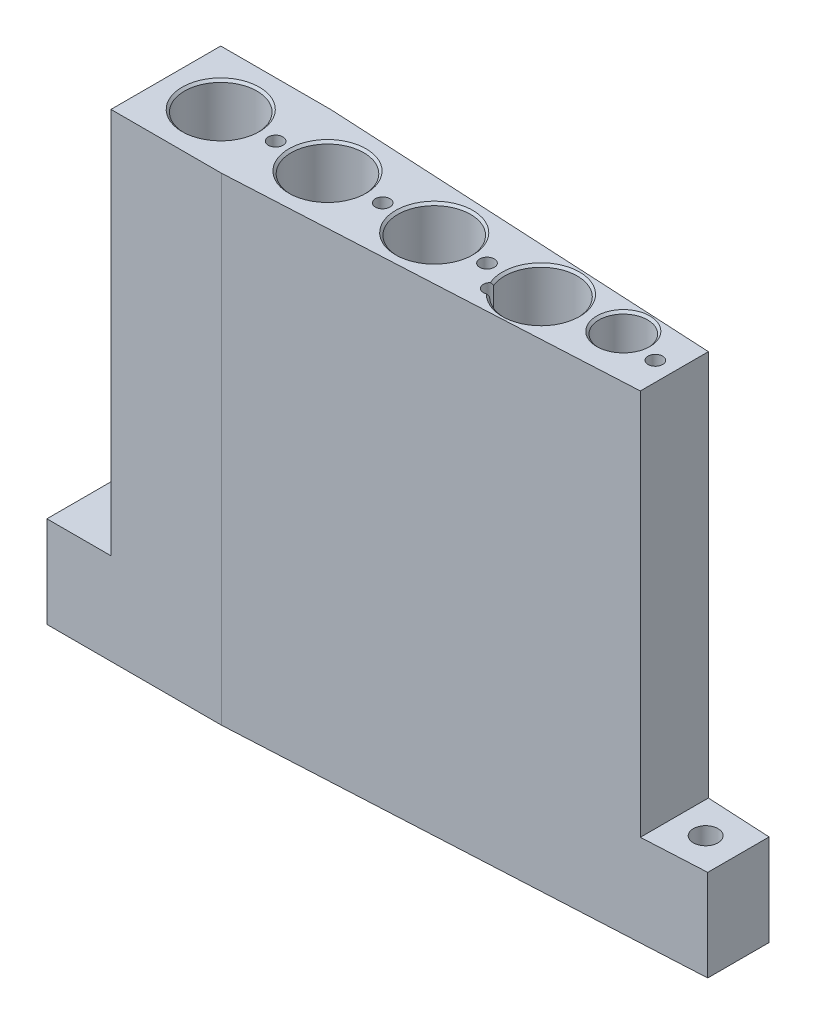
from build123d import *

# Parameters (mm, degrees)
BOSS_EXTRUDE1_DEPTH                = 52.25
F_5_16_0_3125_DIAMETER_HOLE1_D     = 7.9375
F_5_16_0_3125_DIAMETER_HOLE1_DEPTH = 40
F_1_16_0_0625_DIAMETER_HOLE3_D     = 1.5875
LPATTERN1_COUNT                    = 3
LPATTERN1_PITCH                    = 11.666666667
LPATTERN2_COUNT                    = 2
LPATTERN2_PITCH                    = 35
F_1_16_0_0625_DIAMETER_HOLE4_D     = 1.5875
F_4_0_209_DIAMETER_HOLE1_D         = 5.3086
SKETCH14_W                         = 14
SKETCH14_H                         = 7
SKETCH14_W_2                       = 7.440642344
CUT_EXTRUDE1_DEPTH                 = 42.25
M2_5_CLEARANCE_HOLE1_D             = 2.7
F_1_16_0_0625_DIAMETER_HOLE1_D     = 1.5875
F_1_16_0_0625_DIAMETER_HOLE1_DEPTH = 5
F_1_16_0_0625_DIAMETER_HOLE2_D     = 1.5875
F_1_16_0_0625_DIAMETER_HOLE2_DEPTH = 6
F_1_16_0_0625_DIAMETER_HOLE2_TIP   = 0.476933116
M2X0_4_TAPPED_HOLE2_D              = 1.6
M2X0_4_TAPPED_HOLE2_DEPTH          = 5.2
M2X0_4_TAPPED_HOLE2_TIP            = 0.480688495
SKETCH42_OUTSIDE_W                 = 89.206
SKETCH42_OUTSIDE_H                 = 33.626
CUT_EXTRUDE2_DEPTH                 = 88.295125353
CHAMFER2_SIZE                      = 0.93325
CHAMFER2_SIZE2                     = 0.538812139
CHAMFER3_SIZE                      = 0.25


with BuildPart() as part:
    # Sketch1 → Boss-Extrude1 (new body)
    with BuildSketch(Plane(origin=(0, 0, 0), x_dir=(1, 0, 0), z_dir=(0, 1, 0))):
        Polygon((0, 7), (0, -7), (69.58, -3.353466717), (69.58, 3.353466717), align=None)
    extrude(amount=BOSS_EXTRUDE1_DEPTH)

    # 5_16 _0.3125_ Diameter Hole1
    with Locations(Plane(origin=(-12.105298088, 52.25, 2.056471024), x_dir=(-1, 0, 0), z_dir=(0, 1, 0))):
        with Locations((-25.105298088, -2.056471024)):
            f_5_16_0_3125_diameter_hole1 = Hole(F_5_16_0_3125_DIAMETER_HOLE1_D / 2, depth=F_5_16_0_3125_DIAMETER_HOLE1_DEPTH)

    # 1_16 _0.0625_ Diameter Hole3 (through all)
    with Locations(Plane(origin=(0, 0, 0), x_dir=(-1, 0, 0), z_dir=(0, -1, 0))):
        with Locations((-13, 0)):
            f_1_16_0_0625_diameter_hole3 = Hole(F_1_16_0_0625_DIAMETER_HOLE3_D / 2)

    # LPattern1: 5_16 _0.3125_ Diameter Hole1, 1_16 _0.0625_ Diameter Hole3 ×3
    with Locations(*[(i * LPATTERN1_PITCH, 0, 0) for i in range(1, LPATTERN1_COUNT)]):
        add(f_5_16_0_3125_diameter_hole1, mode=Mode.SUBTRACT)
        add(f_1_16_0_0625_diameter_hole3, mode=Mode.SUBTRACT)

    # LPattern2: 5_16 _0.3125_ Diameter Hole1 ×2
    with Locations(*[(i * LPATTERN2_PITCH, 0, 0) for i in range(1, LPATTERN2_COUNT)]):
        add(f_5_16_0_3125_diameter_hole1, mode=Mode.SUBTRACT)

    # 1_16 _0.0625_ Diameter Hole4 (through all)
    with Locations(Plane(origin=(0, 0, 0), x_dir=(-1, 0, 0), z_dir=(0, -1, 0))):
        with Locations((-48.7, 0)):
            Hole(F_1_16_0_0625_DIAMETER_HOLE4_D / 2)

    # 4 _0.209_ Diameter Hole1 (through all)
    with Locations(Plane(origin=(0, 52.25, 0), x_dir=(-1, 0, 0), z_dir=(0, 1, 0))):
        with Locations((-56, -1)):
            Hole(F_4_0_209_DIAMETER_HOLE1_D / 2)

    # Sketch14 → Cut-Extrude1 (cut)
    with BuildSketch(Plane(origin=(52.25, 52.25, 0), x_dir=(0, 0, 1), z_dir=(0, -1, 0))):
        with Locations((0, 48.75)):
            Rectangle(SKETCH14_W, SKETCH14_H)
        with Locations((0, -13.83)):
            Rectangle(SKETCH14_W_2, SKETCH14_H)
    extrude(amount=CUT_EXTRUDE1_DEPTH, mode=Mode.SUBTRACT)

    # M2.5 Clearance Hole1 (through all)
    with Locations(Plane(origin=(-31.378940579, 10, -5.818848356), x_dir=(-1, 0, 0), z_dir=(0, 1, 0))):
        with Locations((-34.878940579, 5.818848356), (-97.378940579, 5.818848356)):
            Hole(M2_5_CLEARANCE_HOLE1_D / 2)

    # 1_16 _0.0625_ Diameter Hole1
    with Locations(Plane.XZ):
        with Locations((8, 0), (62, 0)):
            Hole(F_1_16_0_0625_DIAMETER_HOLE1_D / 2, depth=F_1_16_0_0625_DIAMETER_HOLE1_DEPTH)

    # 1_16 _0.0625_ Diameter Hole2
    with Locations(Plane(origin=(0, 52.25, 0), x_dir=(1, 0, 0), z_dir=(0, 1, 0))):
        with Locations((44.696823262, -2.2)):
            Hole(F_1_16_0_0625_DIAMETER_HOLE2_D / 2, depth=F_1_16_0_0625_DIAMETER_HOLE2_DEPTH)
            with Locations((0, 0, -(F_1_16_0_0625_DIAMETER_HOLE2_DEPTH + F_1_16_0_0625_DIAMETER_HOLE2_TIP / 2))):  # 118° drill point
                Cone(0, F_1_16_0_0625_DIAMETER_HOLE2_D / 2, F_1_16_0_0625_DIAMETER_HOLE2_TIP, mode=Mode.SUBTRACT)

    # M2x0.4 Tapped Hole2
    with Locations(Plane(origin=(0, 52.25, 0), x_dir=(1, 0, 0), z_dir=(0, 1, 0))):
        with Locations((19, 0), (30.7, 0), (42.1, 0), (60.5, 0)):
            Hole(M2X0_4_TAPPED_HOLE2_D / 2, depth=M2X0_4_TAPPED_HOLE2_DEPTH)
            with Locations((0, 0, -(M2X0_4_TAPPED_HOLE2_DEPTH + M2X0_4_TAPPED_HOLE2_TIP / 2))):  # 118° drill point
                Cone(0, M2X0_4_TAPPED_HOLE2_D / 2, M2X0_4_TAPPED_HOLE2_TIP, mode=Mode.SUBTRACT)

    # Sketch42 outside → Cut-Extrude2 (cut, through all)
    with BuildSketch(Plane(origin=(0, 0, 0), x_dir=(1, 0, 0), z_dir=(0, 1, 0))):
        with Locations((34.79, 0)):
            Rectangle(SKETCH42_OUTSIDE_W, SKETCH42_OUTSIDE_H)
        Polygon((0, 6), (19.081136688, 6), (69.58, 3.353466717), (69.58, -3.353466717), (19.081136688, -6), (0, -6), align=None, mode=Mode.SUBTRACT)
    extrude(amount=CUT_EXTRUDE2_DEPTH, mode=Mode.SUBTRACT)

    # Chamfer2
    chamfer2_edges = [part.edges().sort_by_distance(p)[0] for p in [
        (47.90625, 0, 0),
    ]]
    chamfer2_side = [part.faces().sort_by_distance(p)[0] for p in [
        (30.464105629, 0, 0.033747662),
    ]]
    chamfer(chamfer2_edges, length=CHAMFER2_SIZE, length2=CHAMFER2_SIZE2, reference=chamfer2_side[0])

    # Chamfer3
    chamfer3_edges = [part.edges().sort_by_distance(p)[0] for p in [
        (47.236394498, 52.25, -3.894596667),
        (9.03125, 52.25, 0),
        (20.697916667, 52.25, 0),
        (32.364583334, 52.25, 0),
        (53.3457, 52.25, -1),
    ]]
    chamfer(chamfer3_edges, length=CHAMFER3_SIZE)


solid = part.part
